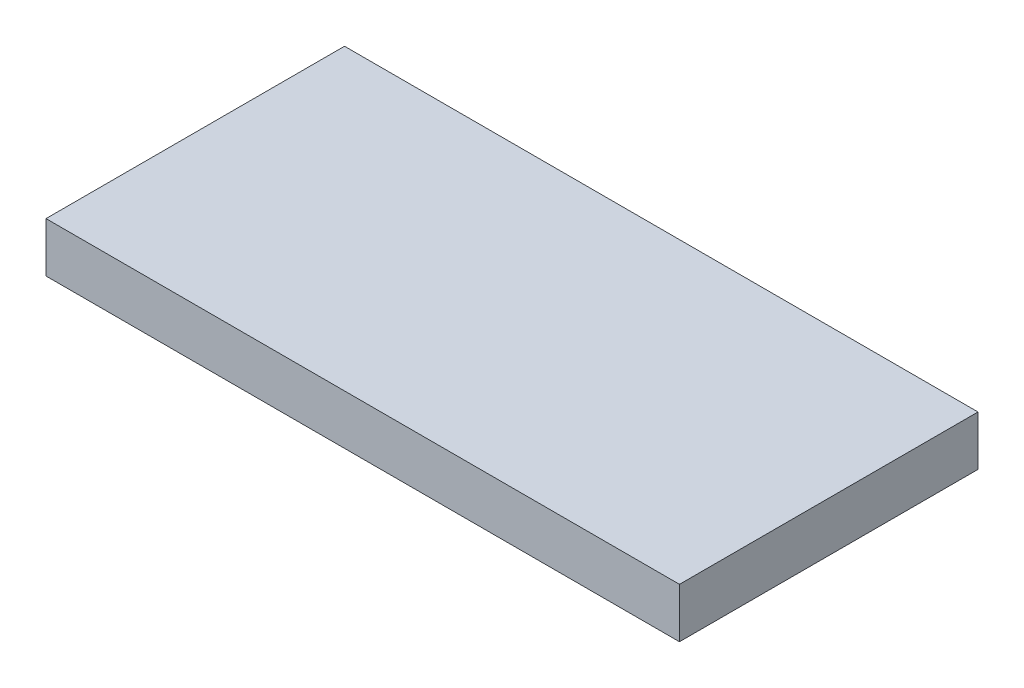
from build123d import *

# Parameters (mm, degrees)
SKETCH1_W      = 1293.59914
SKETCH1_H      = 609.6
EXTRUDE1_DEPTH = 50.8


with BuildPart() as part:
    # Sketch1 → Extrude1 (new, symmetric)
    with BuildSketch(Plane(origin=(0, 0, 0), x_dir=(1, 0, 0), z_dir=(0, 1, 0))):
        Rectangle(SKETCH1_W, SKETCH1_H)
    extrude(amount=EXTRUDE1_DEPTH, both=True)


solid = part.part
